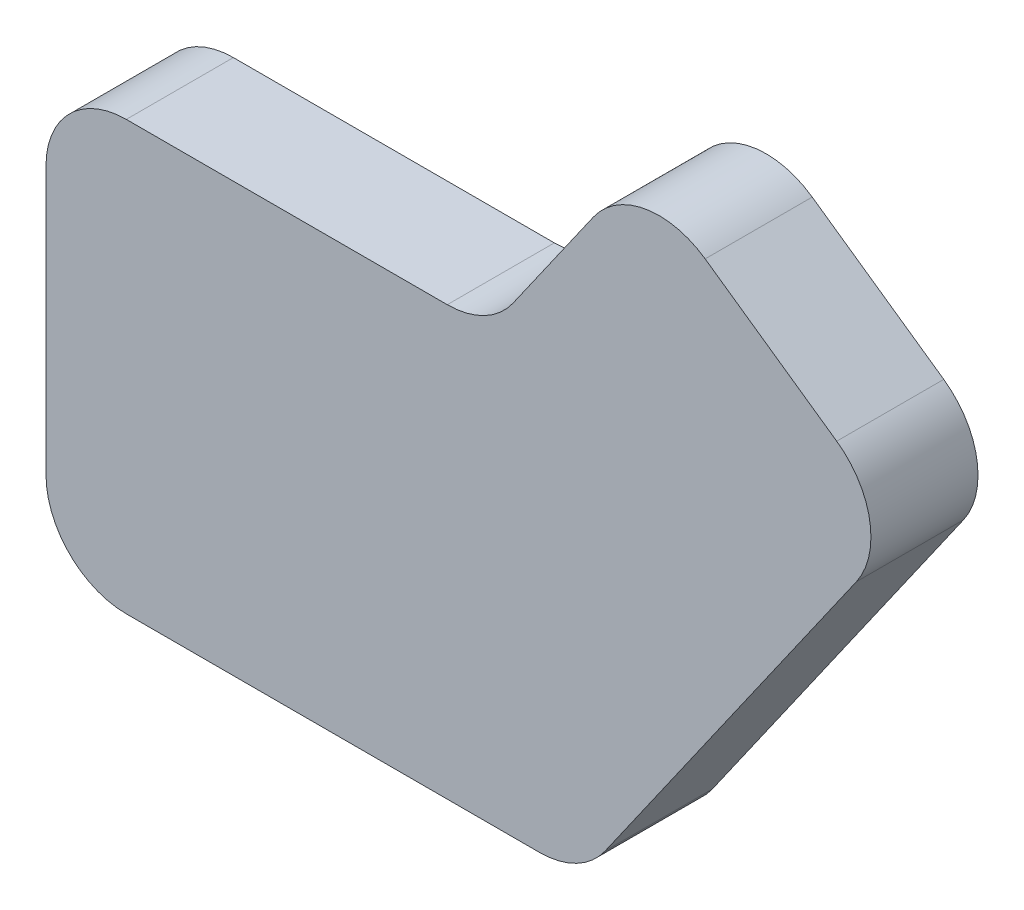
ISO-10303-21;
HEADER;
FILE_DESCRIPTION(('STEP AP214'),'2;1');
FILE_NAME('part.step','',(''),(''),'','','');
FILE_SCHEMA(('AUTOMOTIVE_DESIGN { 1 0 10303 214 1 1 1 1 }'));
ENDSEC;
DATA;
#1=APPLICATION_CONTEXT('core data for automotive mechanical design processes');
#2=APPLICATION_PROTOCOL_DEFINITION('international standard','automotive_design',2000,#1);
#3=PRODUCT_CONTEXT('',#1,'mechanical');
#4=PRODUCT('Part','Part','',(#3));
#5=PRODUCT_RELATED_PRODUCT_CATEGORY('part','',(#4));
#6=PRODUCT_DEFINITION_FORMATION('','',#4);
#7=PRODUCT_DEFINITION_CONTEXT('part definition',#1,'design');
#8=PRODUCT_DEFINITION('design','',#6,#7);
#9=PRODUCT_DEFINITION_SHAPE('','',#8);
#10=(LENGTH_UNIT() NAMED_UNIT(*) SI_UNIT(.MILLI.,.METRE.));
#11=(NAMED_UNIT(*) PLANE_ANGLE_UNIT() SI_UNIT($,.RADIAN.));
#12=(NAMED_UNIT(*) SI_UNIT($,.STERADIAN.) SOLID_ANGLE_UNIT());
#13=UNCERTAINTY_MEASURE_WITH_UNIT(LENGTH_MEASURE(1.E-05),#10,'distance_accuracy_value','');
#14=(GEOMETRIC_REPRESENTATION_CONTEXT(3) GLOBAL_UNCERTAINTY_ASSIGNED_CONTEXT((#13)) GLOBAL_UNIT_ASSIGNED_CONTEXT((#10,
#11,#12)) REPRESENTATION_CONTEXT('',''));
#15=CARTESIAN_POINT('',(0.,0.,0.));
#16=DIRECTION('',(0.,0.,1.));
#17=DIRECTION('',(1.,0.,0.));
#18=AXIS2_PLACEMENT_3D('',#15,#16,#17);
#19=CARTESIAN_POINT('',(4.7625,20.6375,6.35));
#20=DIRECTION('',(0.,0.,-1.));
#21=DIRECTION('',(-1.,0.,0.));
#22=AXIS2_PLACEMENT_3D('',#19,#20,#21);
#23=CYLINDRICAL_SURFACE('',#22,4.7625);
#24=CARTESIAN_POINT('',(4.7625,20.6375,0.));
#25=DIRECTION('',(0.,0.,1.));
#26=DIRECTION('',(1.,0.,0.));
#27=AXIS2_PLACEMENT_3D('',#24,#25,#26);
#28=CIRCLE('',#27,4.7625);
#29=CARTESIAN_POINT('',(4.76250000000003,25.4,0.));
#30=VERTEX_POINT('',#29);
#31=CARTESIAN_POINT('',(0.,20.6375,0.));
#32=VERTEX_POINT('',#31);
#33=EDGE_CURVE('E120',#30,#32,#28,.T.);
#34=ORIENTED_EDGE('',*,*,#33,.T.);
#35=DIRECTION('',(0.,0.,-1.));
#36=VECTOR('',#35,1.);
#37=CARTESIAN_POINT('',(0.,20.6375,6.35));
#38=LINE('',#37,#36);
#39=CARTESIAN_POINT('',(0.,20.6375,6.35));
#40=VERTEX_POINT('',#39);
#41=EDGE_CURVE('E11',#40,#32,#38,.T.);
#42=ORIENTED_EDGE('',*,*,#41,.F.);
#43=CARTESIAN_POINT('',(4.7625,20.6375,6.35));
#44=DIRECTION('',(0.,0.,1.));
#45=DIRECTION('',(1.,0.,0.));
#46=AXIS2_PLACEMENT_3D('',#43,#44,#45);
#47=CIRCLE('',#46,4.7625);
#48=CARTESIAN_POINT('',(4.76250000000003,25.4,6.35));
#49=VERTEX_POINT('',#48);
#50=EDGE_CURVE('E155',#49,#40,#47,.T.);
#51=ORIENTED_EDGE('',*,*,#50,.F.);
#52=DIRECTION('',(0.,0.,-1.));
#53=VECTOR('',#52,1.);
#54=CARTESIAN_POINT('',(4.76250000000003,25.4,6.35));
#55=LINE('',#54,#53);
#56=EDGE_CURVE('E133',#49,#30,#55,.T.);
#57=ORIENTED_EDGE('',*,*,#56,.T.);
#58=EDGE_LOOP('',(#34,#42,#51,#57));
#59=FACE_BOUND('',#58,.T.);
#60=ADVANCED_FACE('F28',(#59),#23,.T.);
#61=CARTESIAN_POINT('',(0.,20.6375,6.35));
#62=DIRECTION('',(1.,0.,0.));
#63=DIRECTION('',(0.,1.,0.));
#64=AXIS2_PLACEMENT_3D('',#61,#62,#63);
#65=PLANE('',#64);
#66=DIRECTION('',(0.,-1.,0.));
#67=VECTOR('',#66,1.);
#68=CARTESIAN_POINT('',(0.,20.6375,0.));
#69=LINE('',#68,#67);
#70=CARTESIAN_POINT('',(0.,4.76250000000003,0.));
#71=VERTEX_POINT('',#70);
#72=EDGE_CURVE('E116',#32,#71,#69,.T.);
#73=ORIENTED_EDGE('',*,*,#72,.T.);
#74=DIRECTION('',(0.,0.,-1.));
#75=VECTOR('',#74,1.);
#76=CARTESIAN_POINT('',(0.,4.76250000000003,6.35));
#77=LINE('',#76,#75);
#78=CARTESIAN_POINT('',(0.,4.76250000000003,6.35));
#79=VERTEX_POINT('',#78);
#80=EDGE_CURVE('E35',#79,#71,#77,.T.);
#81=ORIENTED_EDGE('',*,*,#80,.F.);
#82=DIRECTION('',(0.,-1.,0.));
#83=VECTOR('',#82,1.);
#84=CARTESIAN_POINT('',(0.,20.6375,6.35));
#85=LINE('',#84,#83);
#86=EDGE_CURVE('E129',#40,#79,#85,.T.);
#87=ORIENTED_EDGE('',*,*,#86,.F.);
#88=ORIENTED_EDGE('',*,*,#41,.T.);
#89=EDGE_LOOP('',(#73,#81,#87,#88));
#90=FACE_BOUND('',#89,.T.);
#91=ADVANCED_FACE('F128',(#90),#65,.F.);
#92=CARTESIAN_POINT('',(4.7625,4.7625,6.35));
#93=DIRECTION('',(0.,0.,-1.));
#94=DIRECTION('',(-1.,0.,0.));
#95=AXIS2_PLACEMENT_3D('',#92,#93,#94);
#96=CYLINDRICAL_SURFACE('',#95,4.7625);
#97=CARTESIAN_POINT('',(4.7625,4.7625,0.));
#98=DIRECTION('',(0.,0.,1.));
#99=DIRECTION('',(-1.,0.,0.));
#100=AXIS2_PLACEMENT_3D('',#97,#98,#99);
#101=CIRCLE('',#100,4.7625);
#102=CARTESIAN_POINT('',(4.76250000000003,0.,0.));
#103=VERTEX_POINT('',#102);
#104=EDGE_CURVE('E122',#71,#103,#101,.T.);
#105=ORIENTED_EDGE('',*,*,#104,.T.);
#106=DIRECTION('',(0.,0.,-1.));
#107=VECTOR('',#106,1.);
#108=CARTESIAN_POINT('',(4.76250000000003,0.,6.35));
#109=LINE('',#108,#107);
#110=CARTESIAN_POINT('',(4.76250000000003,0.,6.35));
#111=VERTEX_POINT('',#110);
#112=EDGE_CURVE('E201',#111,#103,#109,.T.);
#113=ORIENTED_EDGE('',*,*,#112,.F.);
#114=CARTESIAN_POINT('',(4.7625,4.7625,6.35));
#115=DIRECTION('',(0.,0.,1.));
#116=DIRECTION('',(-1.,0.,0.));
#117=AXIS2_PLACEMENT_3D('',#114,#115,#116);
#118=CIRCLE('',#117,4.7625);
#119=EDGE_CURVE('E158',#79,#111,#118,.T.);
#120=ORIENTED_EDGE('',*,*,#119,.F.);
#121=ORIENTED_EDGE('',*,*,#80,.T.);
#122=EDGE_LOOP('',(#105,#113,#120,#121));
#123=FACE_BOUND('',#122,.T.);
#124=ADVANCED_FACE('F205',(#123),#96,.T.);
#125=CARTESIAN_POINT('',(4.76250000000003,0.,6.35));
#126=DIRECTION('',(0.,1.,0.));
#127=DIRECTION('',(0.,0.,1.));
#128=AXIS2_PLACEMENT_3D('',#125,#126,#127);
#129=PLANE('',#128);
#130=DIRECTION('',(1.,0.,0.));
#131=VECTOR('',#130,1.);
#132=CARTESIAN_POINT('',(4.76250000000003,0.,0.));
#133=LINE('',#132,#131);
#134=CARTESIAN_POINT('',(29.2707994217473,0.,0.));
#135=VERTEX_POINT('',#134);
#136=EDGE_CURVE('E137',#103,#135,#133,.T.);
#137=ORIENTED_EDGE('',*,*,#136,.T.);
#138=DIRECTION('',(0.,0.,-1.));
#139=VECTOR('',#138,1.);
#140=CARTESIAN_POINT('',(29.2707994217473,0.,6.35));
#141=LINE('',#140,#139);
#142=CARTESIAN_POINT('',(29.2707994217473,0.,6.35));
#143=VERTEX_POINT('',#142);
#144=EDGE_CURVE('E198',#143,#135,#141,.T.);
#145=ORIENTED_EDGE('',*,*,#144,.F.);
#146=DIRECTION('',(1.,0.,0.));
#147=VECTOR('',#146,1.);
#148=CARTESIAN_POINT('',(4.76250000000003,0.,6.35));
#149=LINE('',#148,#147);
#150=EDGE_CURVE('E160',#111,#143,#149,.T.);
#151=ORIENTED_EDGE('',*,*,#150,.F.);
#152=ORIENTED_EDGE('',*,*,#112,.T.);
#153=EDGE_LOOP('',(#137,#145,#151,#152));
#154=FACE_BOUND('',#153,.T.);
#155=ADVANCED_FACE('F213',(#154),#129,.F.);
#156=CARTESIAN_POINT('',(29.2707994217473,4.7625,6.35));
#157=DIRECTION('',(0.,0.,-1.));
#158=DIRECTION('',(-1.,0.,0.));
#159=AXIS2_PLACEMENT_3D('',#156,#157,#158);
#160=CYLINDRICAL_SURFACE('',#159,4.7625);
#161=CARTESIAN_POINT('',(29.2707994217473,4.7625,0.));
#162=DIRECTION('',(0.,0.,1.));
#163=DIRECTION('',(1.,0.,0.));
#164=AXIS2_PLACEMENT_3D('',#161,#162,#163);
#165=CIRCLE('',#164,4.7625);
#166=CARTESIAN_POINT('',(33.1720110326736,2.03084222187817,0.));
#167=VERTEX_POINT('',#166);
#168=EDGE_CURVE('E139',#135,#167,#165,.T.);
#169=ORIENTED_EDGE('',*,*,#168,.T.);
#170=DIRECTION('',(0.,0.,-1.));
#171=VECTOR('',#170,1.);
#172=CARTESIAN_POINT('',(33.1720110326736,2.03084222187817,6.35));
#173=LINE('',#172,#171);
#174=CARTESIAN_POINT('',(33.1720110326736,2.03084222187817,6.35));
#175=VERTEX_POINT('',#174);
#176=EDGE_CURVE('E195',#175,#167,#173,.T.);
#177=ORIENTED_EDGE('',*,*,#176,.F.);
#178=CARTESIAN_POINT('',(29.2707994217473,4.7625,6.35));
#179=DIRECTION('',(0.,0.,1.));
#180=DIRECTION('',(1.,0.,0.));
#181=AXIS2_PLACEMENT_3D('',#178,#179,#180);
#182=CIRCLE('',#181,4.7625);
#183=EDGE_CURVE('E162',#143,#175,#182,.T.);
#184=ORIENTED_EDGE('',*,*,#183,.F.);
#185=ORIENTED_EDGE('',*,*,#144,.T.);
#186=EDGE_LOOP('',(#169,#177,#184,#185));
#187=FACE_BOUND('',#186,.T.);
#188=ADVANCED_FACE('F216',(#187),#160,.T.);
#189=CARTESIAN_POINT('',(33.1720110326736,2.03084222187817,6.35));
#190=DIRECTION('',(-0.819152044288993,0.573576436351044,0.));
#191=DIRECTION('',(-0.573576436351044,-0.819152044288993,0.));
#192=AXIS2_PLACEMENT_3D('',#189,#190,#191);
#193=PLANE('',#192);
#194=DIRECTION('',(0.573576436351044,0.819152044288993,0.));
#195=VECTOR('',#194,1.);
#196=CARTESIAN_POINT('',(33.1720110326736,2.03084222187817,0.));
#197=LINE('',#196,#195);
#198=CARTESIAN_POINT('',(48.0683422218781,23.3050079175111,0.));
#199=VERTEX_POINT('',#198);
#200=EDGE_CURVE('E141',#167,#199,#197,.T.);
#201=ORIENTED_EDGE('',*,*,#200,.T.);
#202=DIRECTION('',(0.,0.,-1.));
#203=VECTOR('',#202,1.);
#204=CARTESIAN_POINT('',(48.0683422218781,23.3050079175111,6.35));
#205=LINE('',#204,#203);
#206=CARTESIAN_POINT('',(48.0683422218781,23.3050079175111,6.35));
#207=VERTEX_POINT('',#206);
#208=EDGE_CURVE('E192',#207,#199,#205,.T.);
#209=ORIENTED_EDGE('',*,*,#208,.F.);
#210=DIRECTION('',(0.573576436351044,0.819152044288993,0.));
#211=VECTOR('',#210,1.);
#212=CARTESIAN_POINT('',(33.1720110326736,2.03084222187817,6.35));
#213=LINE('',#212,#211);
#214=EDGE_CURVE('E164',#175,#207,#213,.T.);
#215=ORIENTED_EDGE('',*,*,#214,.F.);
#216=ORIENTED_EDGE('',*,*,#176,.T.);
#217=EDGE_LOOP('',(#201,#209,#215,#216));
#218=FACE_BOUND('',#217,.T.);
#219=ADVANCED_FACE('F221',(#218),#193,.F.);
#220=CARTESIAN_POINT('',(44.1671306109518,26.036665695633,6.35));
#221=DIRECTION('',(0.,0.,-1.));
#222=DIRECTION('',(-1.,0.,0.));
#223=AXIS2_PLACEMENT_3D('',#220,#221,#222);
#224=CYLINDRICAL_SURFACE('',#223,4.7625);
#225=CARTESIAN_POINT('',(44.1671306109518,26.036665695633,0.));
#226=DIRECTION('',(0.,0.,1.));
#227=DIRECTION('',(1.,0.,0.));
#228=AXIS2_PLACEMENT_3D('',#225,#226,#227);
#229=CIRCLE('',#228,4.7625);
#230=CARTESIAN_POINT('',(46.8987883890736,29.9378773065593,0.));
#231=VERTEX_POINT('',#230);
#232=EDGE_CURVE('E143',#199,#231,#229,.T.);
#233=ORIENTED_EDGE('',*,*,#232,.T.);
#234=DIRECTION('',(0.,0.,-1.));
#235=VECTOR('',#234,1.);
#236=CARTESIAN_POINT('',(46.8987883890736,29.9378773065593,6.35));
#237=LINE('',#236,#235);
#238=CARTESIAN_POINT('',(46.8987883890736,29.9378773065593,6.35));
#239=VERTEX_POINT('',#238);
#240=EDGE_CURVE('E189',#239,#231,#237,.T.);
#241=ORIENTED_EDGE('',*,*,#240,.F.);
#242=CARTESIAN_POINT('',(44.1671306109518,26.036665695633,6.35));
#243=DIRECTION('',(0.,0.,1.));
#244=DIRECTION('',(1.,0.,0.));
#245=AXIS2_PLACEMENT_3D('',#242,#243,#244);
#246=CIRCLE('',#245,4.7625);
#247=EDGE_CURVE('E166',#207,#239,#246,.T.);
#248=ORIENTED_EDGE('',*,*,#247,.F.);
#249=ORIENTED_EDGE('',*,*,#208,.T.);
#250=EDGE_LOOP('',(#233,#241,#248,#249));
#251=FACE_BOUND('',#250,.T.);
#252=ADVANCED_FACE('F227',(#251),#224,.T.);
#253=CARTESIAN_POINT('',(46.8987883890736,29.9378773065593,6.35));
#254=DIRECTION('',(-0.573576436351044,-0.819152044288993,0.));
#255=DIRECTION('',(0.819152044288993,-0.573576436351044,0.));
#256=AXIS2_PLACEMENT_3D('',#253,#254,#255);
#257=PLANE('',#256);
#258=DIRECTION('',(-0.819152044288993,0.573576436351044,0.));
#259=VECTOR('',#258,1.);
#260=CARTESIAN_POINT('',(46.8987883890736,29.9378773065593,0.));
#261=LINE('',#260,#259);
#262=CARTESIAN_POINT('',(39.096365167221,35.401192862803,0.));
#263=VERTEX_POINT('',#262);
#264=EDGE_CURVE('E145',#231,#263,#261,.T.);
#265=ORIENTED_EDGE('',*,*,#264,.T.);
#266=DIRECTION('',(0.,0.,-1.));
#267=VECTOR('',#266,1.);
#268=CARTESIAN_POINT('',(39.096365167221,35.401192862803,6.35));
#269=LINE('',#268,#267);
#270=CARTESIAN_POINT('',(39.096365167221,35.401192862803,6.35));
#271=VERTEX_POINT('',#270);
#272=EDGE_CURVE('E186',#271,#263,#269,.T.);
#273=ORIENTED_EDGE('',*,*,#272,.F.);
#274=DIRECTION('',(-0.819152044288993,0.573576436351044,0.));
#275=VECTOR('',#274,1.);
#276=CARTESIAN_POINT('',(46.8987883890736,29.9378773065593,6.35));
#277=LINE('',#276,#275);
#278=EDGE_CURVE('E168',#239,#271,#277,.T.);
#279=ORIENTED_EDGE('',*,*,#278,.F.);
#280=ORIENTED_EDGE('',*,*,#240,.T.);
#281=EDGE_LOOP('',(#265,#273,#279,#280));
#282=FACE_BOUND('',#281,.T.);
#283=ADVANCED_FACE('F231',(#282),#257,.F.);
#284=CARTESIAN_POINT('',(36.3647073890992,31.4999812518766,6.35));
#285=DIRECTION('',(0.,0.,-1.));
#286=DIRECTION('',(-1.,0.,0.));
#287=AXIS2_PLACEMENT_3D('',#284,#285,#286);
#288=CYLINDRICAL_SURFACE('',#287,4.7625);
#289=CARTESIAN_POINT('',(36.3647073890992,31.4999812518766,0.));
#290=DIRECTION('',(0.,0.,1.));
#291=DIRECTION('',(1.,0.,0.));
#292=AXIS2_PLACEMENT_3D('',#289,#290,#291);
#293=CIRCLE('',#292,4.7625);
#294=CARTESIAN_POINT('',(32.4634957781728,34.2316390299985,0.));
#295=VERTEX_POINT('',#294);
#296=EDGE_CURVE('E147',#263,#295,#293,.T.);
#297=ORIENTED_EDGE('',*,*,#296,.T.);
#298=DIRECTION('',(0.,0.,-1.));
#299=VECTOR('',#298,1.);
#300=CARTESIAN_POINT('',(32.4634957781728,34.2316390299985,6.35));
#301=LINE('',#300,#299);
#302=CARTESIAN_POINT('',(32.4634957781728,34.2316390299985,6.35));
#303=VERTEX_POINT('',#302);
#304=EDGE_CURVE('E183',#303,#295,#301,.T.);
#305=ORIENTED_EDGE('',*,*,#304,.F.);
#306=CARTESIAN_POINT('',(36.3647073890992,31.4999812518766,6.35));
#307=DIRECTION('',(0.,0.,1.));
#308=DIRECTION('',(1.,0.,0.));
#309=AXIS2_PLACEMENT_3D('',#306,#307,#308);
#310=CIRCLE('',#309,4.7625);
#311=EDGE_CURVE('E170',#271,#303,#310,.T.);
#312=ORIENTED_EDGE('',*,*,#311,.F.);
#313=ORIENTED_EDGE('',*,*,#272,.T.);
#314=EDGE_LOOP('',(#297,#305,#312,#313));
#315=FACE_BOUND('',#314,.T.);
#316=ADVANCED_FACE('F236',(#315),#288,.T.);
#317=CARTESIAN_POINT('',(32.4634957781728,34.2316390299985,6.35));
#318=DIRECTION('',(0.819152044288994,-0.573576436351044,0.));
#319=DIRECTION('',(0.573576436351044,0.819152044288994,0.));
#320=AXIS2_PLACEMENT_3D('',#317,#318,#319);
#321=PLANE('',#320);
#322=DIRECTION('',(-0.573576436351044,-0.819152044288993,0.));
#323=VECTOR('',#322,1.);
#324=CARTESIAN_POINT('',(32.4634957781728,34.2316390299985,0.));
#325=LINE('',#324,#323);
#326=CARTESIAN_POINT('',(27.7015265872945,27.4308422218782,0.));
#327=VERTEX_POINT('',#326);
#328=EDGE_CURVE('E149',#295,#327,#325,.T.);
#329=ORIENTED_EDGE('',*,*,#328,.T.);
#330=DIRECTION('',(0.,0.,-1.));
#331=VECTOR('',#330,1.);
#332=CARTESIAN_POINT('',(27.7015265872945,27.4308422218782,6.35));
#333=LINE('',#332,#331);
#334=CARTESIAN_POINT('',(27.7015265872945,27.4308422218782,6.35));
#335=VERTEX_POINT('',#334);
#336=EDGE_CURVE('E180',#335,#327,#333,.T.);
#337=ORIENTED_EDGE('',*,*,#336,.F.);
#338=DIRECTION('',(-0.573576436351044,-0.819152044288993,0.));
#339=VECTOR('',#338,1.);
#340=CARTESIAN_POINT('',(32.4634957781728,34.2316390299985,6.35));
#341=LINE('',#340,#339);
#342=EDGE_CURVE('E172',#303,#335,#341,.T.);
#343=ORIENTED_EDGE('',*,*,#342,.F.);
#344=ORIENTED_EDGE('',*,*,#304,.T.);
#345=EDGE_LOOP('',(#329,#337,#343,#344));
#346=FACE_BOUND('',#345,.T.);
#347=ADVANCED_FACE('F240',(#346),#321,.F.);
#348=CARTESIAN_POINT('',(23.8003149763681,30.1625,6.35));
#349=DIRECTION('',(0.,0.,-1.));
#350=DIRECTION('',(-1.,0.,0.));
#351=AXIS2_PLACEMENT_3D('',#348,#349,#350);
#352=CYLINDRICAL_SURFACE('',#351,4.7625);
#353=CARTESIAN_POINT('',(23.8003149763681,30.1625,0.));
#354=DIRECTION('',(0.,0.,-1.));
#355=DIRECTION('',(-1.,0.,0.));
#356=AXIS2_PLACEMENT_3D('',#353,#354,#355);
#357=CIRCLE('',#356,4.7625);
#358=CARTESIAN_POINT('',(23.8003149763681,25.4,0.));
#359=VERTEX_POINT('',#358);
#360=EDGE_CURVE('E151',#327,#359,#357,.T.);
#361=ORIENTED_EDGE('',*,*,#360,.T.);
#362=DIRECTION('',(0.,0.,-1.));
#363=VECTOR('',#362,1.);
#364=CARTESIAN_POINT('',(23.8003149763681,25.4,6.35));
#365=LINE('',#364,#363);
#366=CARTESIAN_POINT('',(23.8003149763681,25.4,6.35));
#367=VERTEX_POINT('',#366);
#368=EDGE_CURVE('E177',#367,#359,#365,.T.);
#369=ORIENTED_EDGE('',*,*,#368,.F.);
#370=CARTESIAN_POINT('',(23.8003149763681,30.1625,6.35));
#371=DIRECTION('',(0.,0.,-1.));
#372=DIRECTION('',(-1.,0.,0.));
#373=AXIS2_PLACEMENT_3D('',#370,#371,#372);
#374=CIRCLE('',#373,4.7625);
#375=EDGE_CURVE('E47',#335,#367,#374,.T.);
#376=ORIENTED_EDGE('',*,*,#375,.F.);
#377=ORIENTED_EDGE('',*,*,#336,.T.);
#378=EDGE_LOOP('',(#361,#369,#376,#377));
#379=FACE_BOUND('',#378,.T.);
#380=ADVANCED_FACE('F244',(#379),#352,.F.);
#381=CARTESIAN_POINT('',(23.8003149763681,25.4,6.35));
#382=DIRECTION('',(0.,-1.,0.));
#383=DIRECTION('',(1.,0.,0.));
#384=AXIS2_PLACEMENT_3D('',#381,#382,#383);
#385=PLANE('',#384);
#386=DIRECTION('',(-1.,0.,0.));
#387=VECTOR('',#386,1.);
#388=CARTESIAN_POINT('',(23.8003149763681,25.4,0.));
#389=LINE('',#388,#387);
#390=EDGE_CURVE('E153',#359,#30,#389,.T.);
#391=ORIENTED_EDGE('',*,*,#390,.T.);
#392=ORIENTED_EDGE('',*,*,#56,.F.);
#393=DIRECTION('',(-1.,0.,0.));
#394=VECTOR('',#393,1.);
#395=CARTESIAN_POINT('',(23.8003149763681,25.4,6.35));
#396=LINE('',#395,#394);
#397=EDGE_CURVE('E42',#367,#49,#396,.T.);
#398=ORIENTED_EDGE('',*,*,#397,.F.);
#399=ORIENTED_EDGE('',*,*,#368,.T.);
#400=EDGE_LOOP('',(#391,#392,#398,#399));
#401=FACE_BOUND('',#400,.T.);
#402=ADVANCED_FACE('F246',(#401),#385,.F.);
#403=CARTESIAN_POINT('',(4.7625,20.6375,6.35));
#404=DIRECTION('',(0.,0.,1.));
#405=DIRECTION('',(1.,0.,0.));
#406=AXIS2_PLACEMENT_3D('',#403,#404,#405);
#407=PLANE('',#406);
#408=ORIENTED_EDGE('',*,*,#50,.T.);
#409=ORIENTED_EDGE('',*,*,#86,.T.);
#410=ORIENTED_EDGE('',*,*,#119,.T.);
#411=ORIENTED_EDGE('',*,*,#150,.T.);
#412=ORIENTED_EDGE('',*,*,#183,.T.);
#413=ORIENTED_EDGE('',*,*,#214,.T.);
#414=ORIENTED_EDGE('',*,*,#247,.T.);
#415=ORIENTED_EDGE('',*,*,#278,.T.);
#416=ORIENTED_EDGE('',*,*,#311,.T.);
#417=ORIENTED_EDGE('',*,*,#342,.T.);
#418=ORIENTED_EDGE('',*,*,#375,.T.);
#419=ORIENTED_EDGE('',*,*,#397,.T.);
#420=EDGE_LOOP('',(#408,#409,#410,#411,#412,#413,#414,#415,#416,#417,#418,#419));
#421=FACE_BOUND('',#420,.T.);
#422=ADVANCED_FACE('F208',(#421),#407,.T.);
#423=CARTESIAN_POINT('',(4.7625,20.6375,0.));
#424=DIRECTION('',(0.,0.,1.));
#425=DIRECTION('',(1.,0.,0.));
#426=AXIS2_PLACEMENT_3D('',#423,#424,#425);
#427=PLANE('',#426);
#428=ORIENTED_EDGE('',*,*,#33,.F.);
#429=ORIENTED_EDGE('',*,*,#390,.F.);
#430=ORIENTED_EDGE('',*,*,#360,.F.);
#431=ORIENTED_EDGE('',*,*,#328,.F.);
#432=ORIENTED_EDGE('',*,*,#296,.F.);
#433=ORIENTED_EDGE('',*,*,#264,.F.);
#434=ORIENTED_EDGE('',*,*,#232,.F.);
#435=ORIENTED_EDGE('',*,*,#200,.F.);
#436=ORIENTED_EDGE('',*,*,#168,.F.);
#437=ORIENTED_EDGE('',*,*,#136,.F.);
#438=ORIENTED_EDGE('',*,*,#104,.F.);
#439=ORIENTED_EDGE('',*,*,#72,.F.);
#440=EDGE_LOOP('',(#428,#429,#430,#431,#432,#433,#434,#435,#436,#437,#438,#439));
#441=FACE_BOUND('',#440,.T.);
#442=ADVANCED_FACE('F117',(#441),#427,.F.);
#443=CLOSED_SHELL('',(#60,#91,#124,#155,#188,#219,#252,#283,#316,#347,#380,#402,#422,#442));
#444=MANIFOLD_SOLID_BREP('B2',#443);
#445=ADVANCED_BREP_SHAPE_REPRESENTATION('',(#18,#444),#14);
#446=SHAPE_DEFINITION_REPRESENTATION(#9,#445);
ENDSEC;
END-ISO-10303-21;
